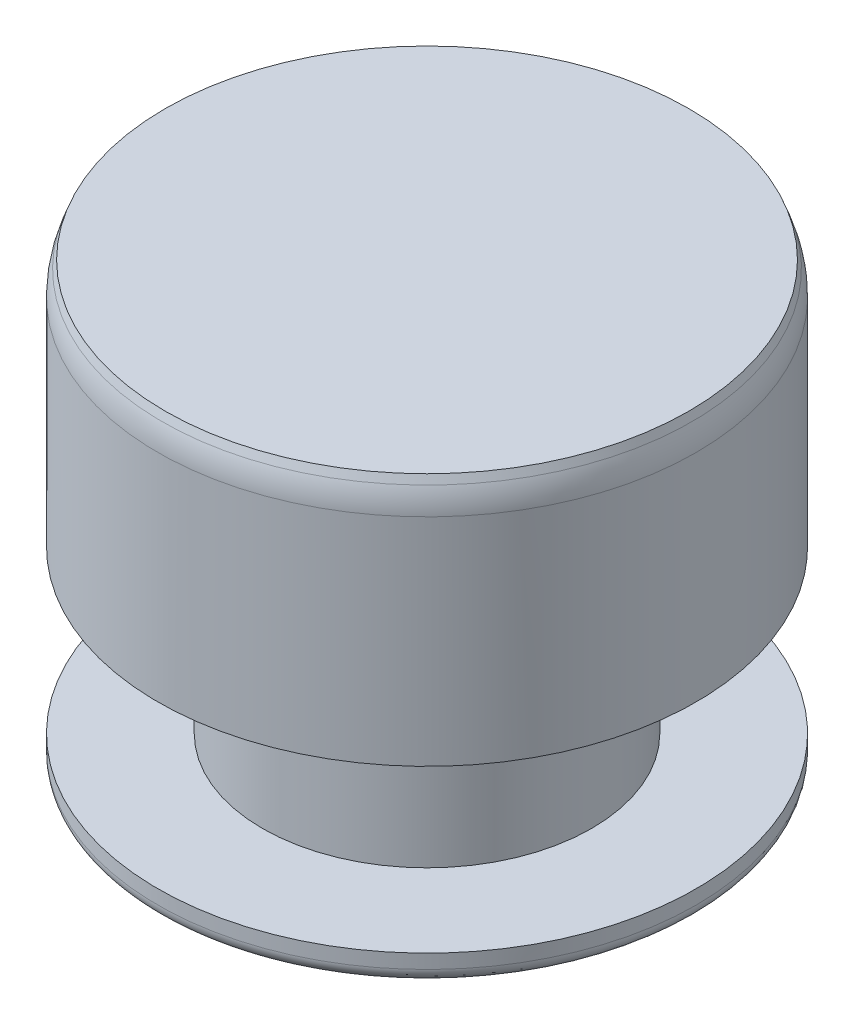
from build123d import *

# Parameters (mm, degrees)
FILLET1_R = 0.2
FILLET2_R = 1


with BuildPart() as part:
    # Sketch1 → Revolve1 (revolve)
    with BuildSketch(Plane.XY, mode=Mode.PRIVATE) as revolve1_sk:
        Polygon((0, 0), (0, -7.99956969), (0.5, -7.99956969), (3.76, -6.040764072), (3.76, -5.73), (2.3, -5.73), (2.3, -3.47), (3.76, -3.47), (3.76, -0.274747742), (3.66, 0), align=None)
    revolve(revolve1_sk.sketch.rotate(Axis((0, 0, 0), (0, -1, 0)), 180), axis=Axis((0, 0, 0), (0, -1, 0)))

    # Fillet1
    fillet1_edges = [part.edges().sort_by_distance(p)[0] for p in [
        (3.76, -6.040764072, 0),
    ]]
    fillet(fillet1_edges, radius=FILLET1_R)

    # Fillet2
    fillet2_edges = [part.edges().sort_by_distance(p)[0] for p in [
        (3.76, -0.274747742, 0),
    ]]
    fillet(fillet2_edges, radius=FILLET2_R)


solid = part.part
